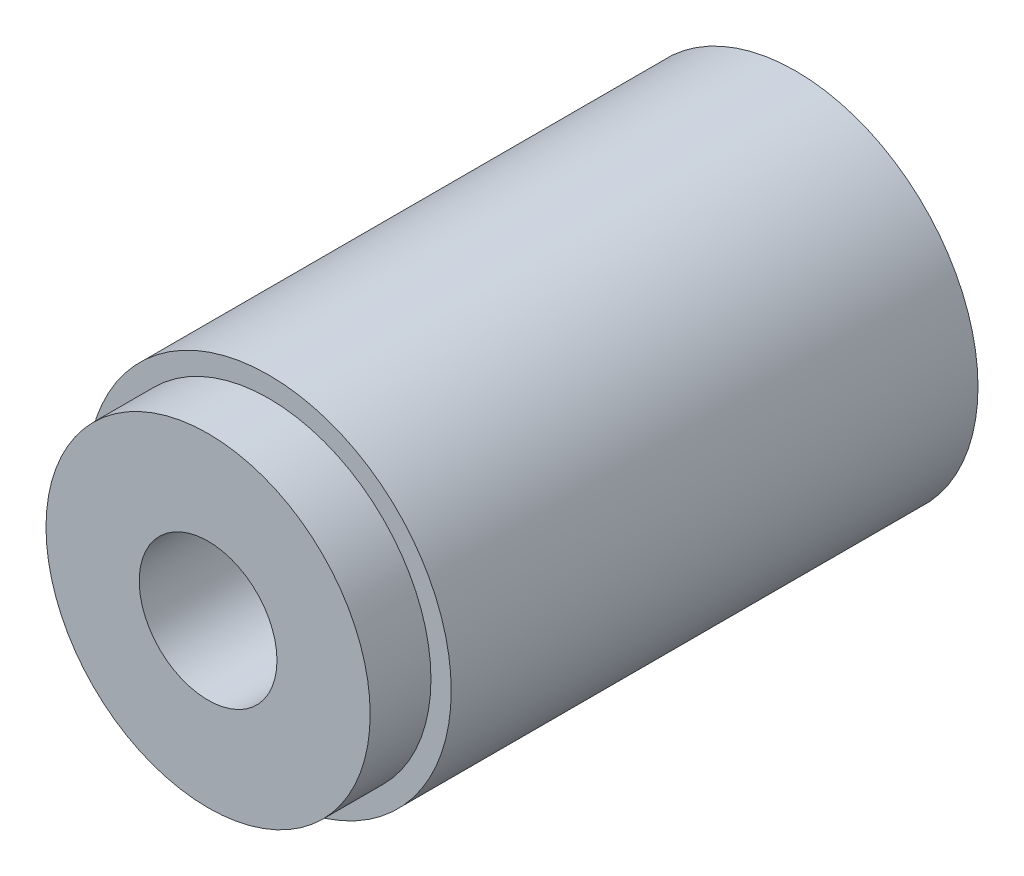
ISO-10303-21;
HEADER;
FILE_DESCRIPTION(('STEP AP214'),'2;1');
FILE_NAME('part.step','',(''),(''),'','','');
FILE_SCHEMA(('AUTOMOTIVE_DESIGN { 1 0 10303 214 1 1 1 1 }'));
ENDSEC;
DATA;
#1=APPLICATION_CONTEXT('core data for automotive mechanical design processes');
#2=APPLICATION_PROTOCOL_DEFINITION('international standard','automotive_design',2000,#1);
#3=PRODUCT_CONTEXT('',#1,'mechanical');
#4=PRODUCT('Part','Part','',(#3));
#5=PRODUCT_RELATED_PRODUCT_CATEGORY('part','',(#4));
#6=PRODUCT_DEFINITION_FORMATION('','',#4);
#7=PRODUCT_DEFINITION_CONTEXT('part definition',#1,'design');
#8=PRODUCT_DEFINITION('design','',#6,#7);
#9=PRODUCT_DEFINITION_SHAPE('','',#8);
#10=(LENGTH_UNIT() NAMED_UNIT(*) SI_UNIT(.MILLI.,.METRE.));
#11=(NAMED_UNIT(*) PLANE_ANGLE_UNIT() SI_UNIT($,.RADIAN.));
#12=(NAMED_UNIT(*) SI_UNIT($,.STERADIAN.) SOLID_ANGLE_UNIT());
#13=UNCERTAINTY_MEASURE_WITH_UNIT(LENGTH_MEASURE(1.E-05),#10,'distance_accuracy_value','');
#14=(GEOMETRIC_REPRESENTATION_CONTEXT(3) GLOBAL_UNCERTAINTY_ASSIGNED_CONTEXT((#13)) GLOBAL_UNIT_ASSIGNED_CONTEXT((#10,
#11,#12)) REPRESENTATION_CONTEXT('',''));
#15=CARTESIAN_POINT('',(0.,0.,0.));
#16=DIRECTION('',(0.,0.,1.));
#17=DIRECTION('',(1.,0.,0.));
#18=AXIS2_PLACEMENT_3D('',#15,#16,#17);
#19=CARTESIAN_POINT('',(0.,0.,130.));
#20=DIRECTION('',(0.,0.,1.));
#21=DIRECTION('',(1.,0.,0.));
#22=AXIS2_PLACEMENT_3D('',#19,#20,#21);
#23=PLANE('',#22);
#24=CARTESIAN_POINT('',(0.,0.,130.));
#25=DIRECTION('',(0.,0.,1.));
#26=DIRECTION('',(1.,0.,0.));
#27=AXIS2_PLACEMENT_3D('',#24,#25,#26);
#28=CIRCLE('',#27,45.);
#29=CARTESIAN_POINT('',(45.,0.,130.));
#30=VERTEX_POINT('',#29);
#31=EDGE_CURVE('E10',#30,#30,#28,.T.);
#32=ORIENTED_EDGE('',*,*,#31,.T.);
#33=EDGE_LOOP('',(#32));
#34=FACE_BOUND('',#33,.T.);
#35=CARTESIAN_POINT('',(0.,0.,130.));
#36=DIRECTION('',(0.,0.,1.));
#37=DIRECTION('',(1.,0.,0.));
#38=AXIS2_PLACEMENT_3D('',#35,#36,#37);
#39=CIRCLE('',#38,40.);
#40=CARTESIAN_POINT('',(40.,0.,130.));
#41=VERTEX_POINT('',#40);
#42=EDGE_CURVE('E46',#41,#41,#39,.T.);
#43=ORIENTED_EDGE('',*,*,#42,.F.);
#44=EDGE_LOOP('',(#43));
#45=FACE_BOUND('',#44,.T.);
#46=ADVANCED_FACE('F33',(#34,#45),#23,.T.);
#47=CARTESIAN_POINT('',(0.,0.,130.));
#48=DIRECTION('',(0.,0.,-1.));
#49=DIRECTION('',(-1.,0.,0.));
#50=AXIS2_PLACEMENT_3D('',#47,#48,#49);
#51=CYLINDRICAL_SURFACE('',#50,45.);
#52=ORIENTED_EDGE('',*,*,#31,.F.);
#53=EDGE_LOOP('',(#52));
#54=FACE_BOUND('',#53,.T.);
#55=CARTESIAN_POINT('',(0.,0.,0.));
#56=DIRECTION('',(0.,0.,1.));
#57=DIRECTION('',(1.,0.,0.));
#58=AXIS2_PLACEMENT_3D('',#55,#56,#57);
#59=CIRCLE('',#58,45.);
#60=CARTESIAN_POINT('',(45.,0.,0.));
#61=VERTEX_POINT('',#60);
#62=EDGE_CURVE('E37',#61,#61,#59,.T.);
#63=ORIENTED_EDGE('',*,*,#62,.T.);
#64=EDGE_LOOP('',(#63));
#65=FACE_BOUND('',#64,.T.);
#66=ADVANCED_FACE('F35',(#54,#65),#51,.T.);
#67=CARTESIAN_POINT('',(0.,0.,0.));
#68=DIRECTION('',(0.,0.,1.));
#69=DIRECTION('',(1.,0.,0.));
#70=AXIS2_PLACEMENT_3D('',#67,#68,#69);
#71=PLANE('',#70);
#72=CARTESIAN_POINT('',(0.,0.,0.));
#73=DIRECTION('',(0.,0.,1.));
#74=DIRECTION('',(1.,0.,0.));
#75=AXIS2_PLACEMENT_3D('',#72,#73,#74);
#76=CIRCLE('',#75,17.);
#77=CARTESIAN_POINT('',(17.,0.,0.));
#78=VERTEX_POINT('',#77);
#79=EDGE_CURVE('E49',#78,#78,#76,.T.);
#80=ORIENTED_EDGE('',*,*,#79,.T.);
#81=EDGE_LOOP('',(#80));
#82=FACE_BOUND('',#81,.T.);
#83=ORIENTED_EDGE('',*,*,#62,.F.);
#84=EDGE_LOOP('',(#83));
#85=FACE_BOUND('',#84,.T.);
#86=ADVANCED_FACE('F58',(#82,#85),#71,.F.);
#87=CARTESIAN_POINT('',(0.,0.,145.));
#88=DIRECTION('',(0.,0.,-1.));
#89=DIRECTION('',(-1.,0.,0.));
#90=AXIS2_PLACEMENT_3D('',#87,#88,#89);
#91=CYLINDRICAL_SURFACE('',#90,40.);
#92=CARTESIAN_POINT('',(0.,0.,145.));
#93=DIRECTION('',(0.,0.,1.));
#94=DIRECTION('',(1.,0.,0.));
#95=AXIS2_PLACEMENT_3D('',#92,#93,#94);
#96=CIRCLE('',#95,40.);
#97=CARTESIAN_POINT('',(40.,0.,145.));
#98=VERTEX_POINT('',#97);
#99=EDGE_CURVE('E44',#98,#98,#96,.T.);
#100=ORIENTED_EDGE('',*,*,#99,.F.);
#101=EDGE_LOOP('',(#100));
#102=FACE_BOUND('',#101,.T.);
#103=ORIENTED_EDGE('',*,*,#42,.T.);
#104=EDGE_LOOP('',(#103));
#105=FACE_BOUND('',#104,.T.);
#106=ADVANCED_FACE('F70',(#102,#105),#91,.T.);
#107=CARTESIAN_POINT('',(0.,0.,145.));
#108=DIRECTION('',(0.,0.,1.));
#109=DIRECTION('',(1.,0.,0.));
#110=AXIS2_PLACEMENT_3D('',#107,#108,#109);
#111=PLANE('',#110);
#112=CARTESIAN_POINT('',(0.,0.,145.));
#113=DIRECTION('',(0.,0.,1.));
#114=DIRECTION('',(1.,0.,0.));
#115=AXIS2_PLACEMENT_3D('',#112,#113,#114);
#116=CIRCLE('',#115,17.);
#117=CARTESIAN_POINT('',(17.,0.,145.));
#118=VERTEX_POINT('',#117);
#119=EDGE_CURVE('E52',#118,#118,#116,.T.);
#120=ORIENTED_EDGE('',*,*,#119,.F.);
#121=EDGE_LOOP('',(#120));
#122=FACE_BOUND('',#121,.T.);
#123=ORIENTED_EDGE('',*,*,#99,.T.);
#124=EDGE_LOOP('',(#123));
#125=FACE_BOUND('',#124,.T.);
#126=ADVANCED_FACE('F64',(#122,#125),#111,.T.);
#127=CARTESIAN_POINT('',(0.,0.,0.));
#128=DIRECTION('',(0.,0.,1.));
#129=DIRECTION('',(1.,0.,0.));
#130=AXIS2_PLACEMENT_3D('',#127,#128,#129);
#131=CYLINDRICAL_SURFACE('',#130,17.);
#132=ORIENTED_EDGE('',*,*,#79,.F.);
#133=EDGE_LOOP('',(#132));
#134=FACE_BOUND('',#133,.T.);
#135=ORIENTED_EDGE('',*,*,#119,.T.);
#136=EDGE_LOOP('',(#135));
#137=FACE_BOUND('',#136,.T.);
#138=ADVANCED_FACE('F61',(#134,#137),#131,.F.);
#139=CLOSED_SHELL('',(#46,#66,#86,#106,#126,#138));
#140=MANIFOLD_SOLID_BREP('B2',#139);
#141=ADVANCED_BREP_SHAPE_REPRESENTATION('',(#18,#140),#14);
#142=SHAPE_DEFINITION_REPRESENTATION(#9,#141);
ENDSEC;
END-ISO-10303-21;
